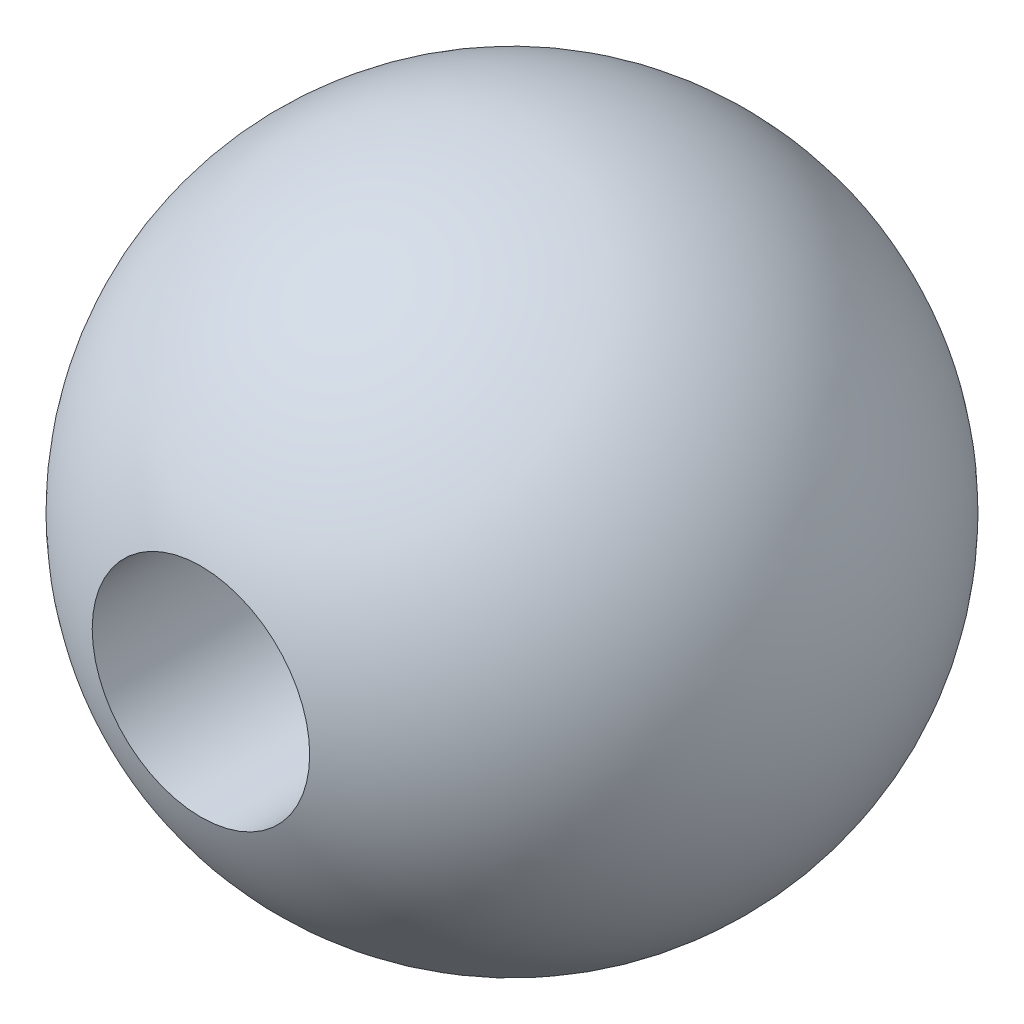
from build123d import *

# Parameters (mm, degrees)
OTW_R_GWINTOWANY_M41_D     = 3.3
OTW_R_GWINTOWANY_M41_DEPTH = 7.008579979
OTW_R_GWINTOWANY_M41_TIP   = 0.991420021


with BuildPart() as part:
    # Szkic1 → Obr_t1 (revolve)
    with BuildSketch(Plane.XY):
        with BuildLine():
            Line((-5, 0), (5, 0))
            ThreePointArc((5, 0), (0, 5), (-5, 0))
        make_face()
    revolve(axis=Axis((-5, 0, 0), (1, 0, 0)))

    # Otw_r gwintowany M41
    with Locations(Plane.XY.offset(5)):
        with Locations((0, 0)):
            Hole(OTW_R_GWINTOWANY_M41_D / 2, depth=OTW_R_GWINTOWANY_M41_DEPTH)
            with Locations((0, 0, -(OTW_R_GWINTOWANY_M41_DEPTH + OTW_R_GWINTOWANY_M41_TIP / 2))):  # 118° drill point
                Cone(0, OTW_R_GWINTOWANY_M41_D / 2, OTW_R_GWINTOWANY_M41_TIP, mode=Mode.SUBTRACT)


solid = part.part
